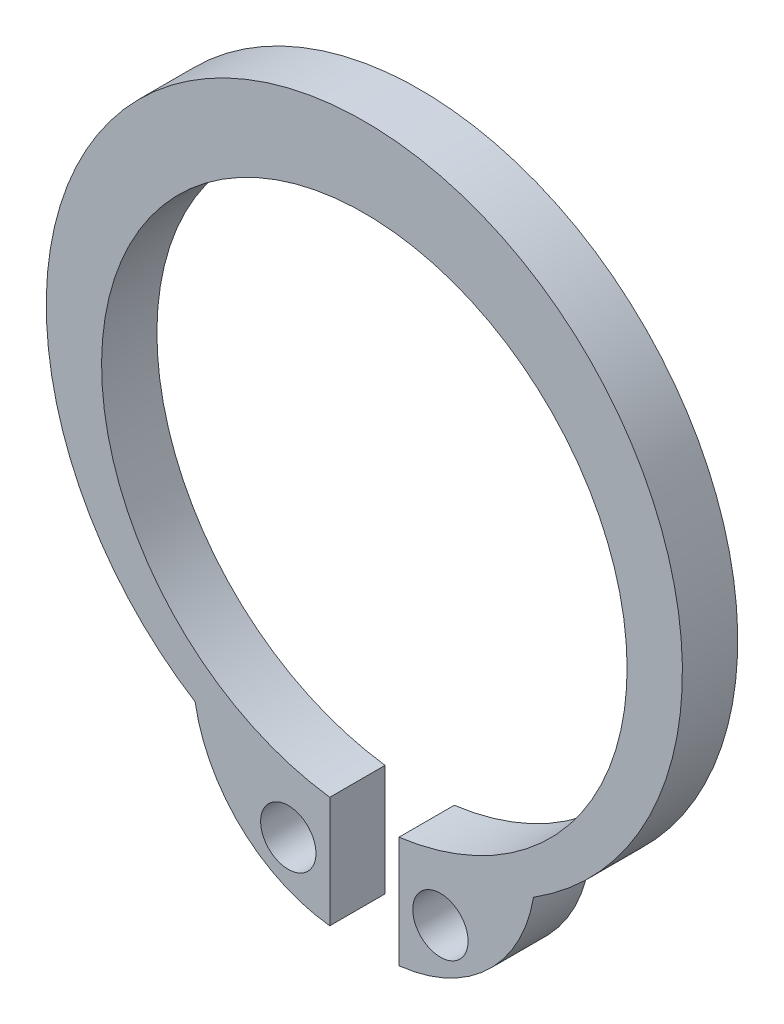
ISO-10303-21;
HEADER;
FILE_DESCRIPTION(('STEP AP214'),'2;1');
FILE_NAME('part.step','',(''),(''),'','','');
FILE_SCHEMA(('AUTOMOTIVE_DESIGN { 1 0 10303 214 1 1 1 1 }'));
ENDSEC;
DATA;
#1=APPLICATION_CONTEXT('core data for automotive mechanical design processes');
#2=APPLICATION_PROTOCOL_DEFINITION('international standard','automotive_design',2000,#1);
#3=PRODUCT_CONTEXT('',#1,'mechanical');
#4=PRODUCT('Part','Part','',(#3));
#5=PRODUCT_RELATED_PRODUCT_CATEGORY('part','',(#4));
#6=PRODUCT_DEFINITION_FORMATION('','',#4);
#7=PRODUCT_DEFINITION_CONTEXT('part definition',#1,'design');
#8=PRODUCT_DEFINITION('design','',#6,#7);
#9=PRODUCT_DEFINITION_SHAPE('','',#8);
#10=(LENGTH_UNIT() NAMED_UNIT(*) SI_UNIT(.MILLI.,.METRE.));
#11=(NAMED_UNIT(*) PLANE_ANGLE_UNIT() SI_UNIT($,.RADIAN.));
#12=(NAMED_UNIT(*) SI_UNIT($,.STERADIAN.) SOLID_ANGLE_UNIT());
#13=UNCERTAINTY_MEASURE_WITH_UNIT(LENGTH_MEASURE(1.E-05),#10,'distance_accuracy_value','');
#14=(GEOMETRIC_REPRESENTATION_CONTEXT(3) GLOBAL_UNCERTAINTY_ASSIGNED_CONTEXT((#13)) GLOBAL_UNIT_ASSIGNED_CONTEXT((#10,
#11,#12)) REPRESENTATION_CONTEXT('',''));
#15=CARTESIAN_POINT('',(0.,0.,0.));
#16=DIRECTION('',(0.,0.,1.));
#17=DIRECTION('',(1.,0.,0.));
#18=AXIS2_PLACEMENT_3D('',#15,#16,#17);
#19=CARTESIAN_POINT('',(0.,0.,0.8));
#20=DIRECTION('',(0.,0.,1.));
#21=DIRECTION('',(1.,0.,0.));
#22=AXIS2_PLACEMENT_3D('',#19,#20,#21);
#23=PLANE('',#22);
#24=CARTESIAN_POINT('',(0.,0.,0.8));
#25=DIRECTION('',(0.,0.,1.));
#26=DIRECTION('',(1.,0.,0.));
#27=AXIS2_PLACEMENT_3D('',#24,#25,#26);
#28=CIRCLE('',#27,3.8);
#29=CARTESIAN_POINT('',(0.500000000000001,-3.76696164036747,0.8));
#30=VERTEX_POINT('',#29);
#31=CARTESIAN_POINT('',(-0.500000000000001,-3.76696164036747,0.8));
#32=VERTEX_POINT('',#31);
#33=EDGE_CURVE('E81',#30,#32,#28,.T.);
#34=ORIENTED_EDGE('',*,*,#33,.F.);
#35=DIRECTION('',(0.,-1.,0.));
#36=VECTOR('',#35,1.);
#37=CARTESIAN_POINT('',(0.500000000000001,-3.76696164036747,0.8));
#38=LINE('',#37,#36);
#39=CARTESIAN_POINT('',(0.5,-5.37680202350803,0.8));
#40=VERTEX_POINT('',#39);
#41=EDGE_CURVE('E87',#30,#40,#38,.T.);
#42=ORIENTED_EDGE('',*,*,#41,.T.);
#43=CARTESIAN_POINT('',(0.262823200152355,-3.17386985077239,0.8));
#44=DIRECTION('',(0.,0.,1.));
#45=DIRECTION('',(1.,0.,0.));
#46=AXIS2_PLACEMENT_3D('',#43,#44,#45);
#47=CIRCLE('',#46,2.21566310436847);
#48=CARTESIAN_POINT('',(2.44717580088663,-3.54503922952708,0.8));
#49=VERTEX_POINT('',#48);
#50=EDGE_CURVE('E122',#40,#49,#47,.T.);
#51=ORIENTED_EDGE('',*,*,#50,.T.);
#52=CARTESIAN_POINT('',(0.,0.35,0.8));
#53=DIRECTION('',(0.,0.,1.));
#54=DIRECTION('',(1.,0.,0.));
#55=AXIS2_PLACEMENT_3D('',#52,#53,#54);
#56=CIRCLE('',#55,4.6);
#57=CARTESIAN_POINT('',(-2.44717580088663,-3.54503922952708,0.8));
#58=VERTEX_POINT('',#57);
#59=EDGE_CURVE('E119',#49,#58,#56,.T.);
#60=ORIENTED_EDGE('',*,*,#59,.T.);
#61=CARTESIAN_POINT('',(-0.262823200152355,-3.17386985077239,0.8));
#62=DIRECTION('',(0.,0.,-1.));
#63=DIRECTION('',(-1.,0.,0.));
#64=AXIS2_PLACEMENT_3D('',#61,#62,#63);
#65=CIRCLE('',#64,2.21566310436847);
#66=CARTESIAN_POINT('',(-0.500000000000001,-5.37680202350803,0.8));
#67=VERTEX_POINT('',#66);
#68=EDGE_CURVE('E116',#67,#58,#65,.T.);
#69=ORIENTED_EDGE('',*,*,#68,.F.);
#70=DIRECTION('',(0.,-1.,0.));
#71=VECTOR('',#70,1.);
#72=CARTESIAN_POINT('',(-0.500000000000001,-3.76696164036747,0.8));
#73=LINE('',#72,#71);
#74=EDGE_CURVE('E114',#32,#67,#73,.T.);
#75=ORIENTED_EDGE('',*,*,#74,.F.);
#76=EDGE_LOOP('',(#34,#42,#51,#60,#69,#75));
#77=FACE_BOUND('',#76,.T.);
#78=CARTESIAN_POINT('',(-1.1,-4.56946386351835,0.8));
#79=DIRECTION('',(0.,0.,1.));
#80=DIRECTION('',(1.,0.,0.));
#81=AXIS2_PLACEMENT_3D('',#78,#79,#80);
#82=CIRCLE('',#81,0.4);
#83=CARTESIAN_POINT('',(-0.700000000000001,-4.56946386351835,0.8));
#84=VERTEX_POINT('',#83);
#85=EDGE_CURVE('E176',#84,#84,#82,.T.);
#86=ORIENTED_EDGE('',*,*,#85,.F.);
#87=EDGE_LOOP('',(#86));
#88=FACE_BOUND('',#87,.T.);
#89=CARTESIAN_POINT('',(1.1,-4.56946386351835,0.8));
#90=DIRECTION('',(0.,0.,-1.));
#91=DIRECTION('',(-1.,0.,0.));
#92=AXIS2_PLACEMENT_3D('',#89,#90,#91);
#93=CIRCLE('',#92,0.4);
#94=CARTESIAN_POINT('',(0.700000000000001,-4.56946386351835,0.8));
#95=VERTEX_POINT('',#94);
#96=EDGE_CURVE('E180',#95,#95,#93,.T.);
#97=ORIENTED_EDGE('',*,*,#96,.T.);
#98=EDGE_LOOP('',(#97));
#99=FACE_BOUND('',#98,.T.);
#100=ADVANCED_FACE('F27',(#77,#88,#99),#23,.T.);
#101=CARTESIAN_POINT('',(0.,0.,0.));
#102=DIRECTION('',(0.,0.,1.));
#103=DIRECTION('',(1.,0.,0.));
#104=AXIS2_PLACEMENT_3D('',#101,#102,#103);
#105=PLANE('',#104);
#106=CARTESIAN_POINT('',(0.,0.,0.));
#107=DIRECTION('',(0.,0.,1.));
#108=DIRECTION('',(1.,0.,0.));
#109=AXIS2_PLACEMENT_3D('',#106,#107,#108);
#110=CIRCLE('',#109,3.8);
#111=CARTESIAN_POINT('',(0.500000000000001,-3.76696164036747,0.));
#112=VERTEX_POINT('',#111);
#113=CARTESIAN_POINT('',(-0.500000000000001,-3.76696164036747,0.));
#114=VERTEX_POINT('',#113);
#115=EDGE_CURVE('E79',#112,#114,#110,.T.);
#116=ORIENTED_EDGE('',*,*,#115,.T.);
#117=DIRECTION('',(0.,-1.,0.));
#118=VECTOR('',#117,1.);
#119=CARTESIAN_POINT('',(-0.500000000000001,-3.76696164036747,0.));
#120=LINE('',#119,#118);
#121=CARTESIAN_POINT('',(-0.500000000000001,-5.37680202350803,0.));
#122=VERTEX_POINT('',#121);
#123=EDGE_CURVE('E94',#114,#122,#120,.T.);
#124=ORIENTED_EDGE('',*,*,#123,.T.);
#125=CARTESIAN_POINT('',(-0.262823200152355,-3.17386985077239,0.));
#126=DIRECTION('',(0.,0.,-1.));
#127=DIRECTION('',(-1.,0.,0.));
#128=AXIS2_PLACEMENT_3D('',#125,#126,#127);
#129=CIRCLE('',#128,2.21566310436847);
#130=CARTESIAN_POINT('',(-2.44717580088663,-3.54503922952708,0.));
#131=VERTEX_POINT('',#130);
#132=EDGE_CURVE('E101',#122,#131,#129,.T.);
#133=ORIENTED_EDGE('',*,*,#132,.T.);
#134=CARTESIAN_POINT('',(0.,0.35,0.));
#135=DIRECTION('',(0.,0.,1.));
#136=DIRECTION('',(1.,0.,0.));
#137=AXIS2_PLACEMENT_3D('',#134,#135,#136);
#138=CIRCLE('',#137,4.6);
#139=CARTESIAN_POINT('',(2.44717580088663,-3.54503922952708,0.));
#140=VERTEX_POINT('',#139);
#141=EDGE_CURVE('E103',#140,#131,#138,.T.);
#142=ORIENTED_EDGE('',*,*,#141,.F.);
#143=CARTESIAN_POINT('',(0.262823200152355,-3.17386985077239,0.));
#144=DIRECTION('',(0.,0.,1.));
#145=DIRECTION('',(1.,0.,0.));
#146=AXIS2_PLACEMENT_3D('',#143,#144,#145);
#147=CIRCLE('',#146,2.21566310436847);
#148=CARTESIAN_POINT('',(0.5,-5.37680202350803,0.));
#149=VERTEX_POINT('',#148);
#150=EDGE_CURVE('E109',#149,#140,#147,.T.);
#151=ORIENTED_EDGE('',*,*,#150,.F.);
#152=DIRECTION('',(0.,-1.,0.));
#153=VECTOR('',#152,1.);
#154=CARTESIAN_POINT('',(0.500000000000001,-3.76696164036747,0.));
#155=LINE('',#154,#153);
#156=EDGE_CURVE('E97',#112,#149,#155,.T.);
#157=ORIENTED_EDGE('',*,*,#156,.F.);
#158=EDGE_LOOP('',(#116,#124,#133,#142,#151,#157));
#159=FACE_BOUND('',#158,.T.);
#160=CARTESIAN_POINT('',(-1.1,-4.56946386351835,0.));
#161=DIRECTION('',(0.,0.,1.));
#162=DIRECTION('',(1.,0.,0.));
#163=AXIS2_PLACEMENT_3D('',#160,#161,#162);
#164=CIRCLE('',#163,0.4);
#165=CARTESIAN_POINT('',(-0.700000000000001,-4.56946386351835,0.));
#166=VERTEX_POINT('',#165);
#167=EDGE_CURVE('E98',#166,#166,#164,.T.);
#168=ORIENTED_EDGE('',*,*,#167,.T.);
#169=EDGE_LOOP('',(#168));
#170=FACE_BOUND('',#169,.T.);
#171=CARTESIAN_POINT('',(1.1,-4.56946386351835,0.));
#172=DIRECTION('',(0.,0.,-1.));
#173=DIRECTION('',(-1.,0.,0.));
#174=AXIS2_PLACEMENT_3D('',#171,#172,#173);
#175=CIRCLE('',#174,0.4);
#176=CARTESIAN_POINT('',(0.700000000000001,-4.56946386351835,0.));
#177=VERTEX_POINT('',#176);
#178=EDGE_CURVE('E177',#177,#177,#175,.T.);
#179=ORIENTED_EDGE('',*,*,#178,.F.);
#180=EDGE_LOOP('',(#179));
#181=FACE_BOUND('',#180,.T.);
#182=ADVANCED_FACE('F91',(#159,#170,#181),#105,.F.);
#183=CARTESIAN_POINT('',(0.,0.,0.8));
#184=DIRECTION('',(0.,0.,-1.));
#185=DIRECTION('',(-1.,0.,0.));
#186=AXIS2_PLACEMENT_3D('',#183,#184,#185);
#187=CYLINDRICAL_SURFACE('',#186,3.8);
#188=DIRECTION('',(0.,0.,-1.));
#189=VECTOR('',#188,1.);
#190=CARTESIAN_POINT('',(0.500000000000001,-3.76696164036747,0.8));
#191=LINE('',#190,#189);
#192=EDGE_CURVE('E11',#30,#112,#191,.T.);
#193=ORIENTED_EDGE('',*,*,#192,.F.);
#194=ORIENTED_EDGE('',*,*,#33,.T.);
#195=DIRECTION('',(0.,0.,-1.));
#196=VECTOR('',#195,1.);
#197=CARTESIAN_POINT('',(-0.500000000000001,-3.76696164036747,0.8));
#198=LINE('',#197,#196);
#199=EDGE_CURVE('E76',#32,#114,#198,.T.);
#200=ORIENTED_EDGE('',*,*,#199,.T.);
#201=ORIENTED_EDGE('',*,*,#115,.F.);
#202=EDGE_LOOP('',(#193,#194,#200,#201));
#203=FACE_BOUND('',#202,.T.);
#204=ADVANCED_FACE('F78',(#203),#187,.F.);
#205=CARTESIAN_POINT('',(0.500000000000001,-3.76696164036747,0.8));
#206=DIRECTION('',(1.,0.,0.));
#207=DIRECTION('',(0.,0.,-1.));
#208=AXIS2_PLACEMENT_3D('',#205,#206,#207);
#209=PLANE('',#208);
#210=DIRECTION('',(0.,0.,-1.));
#211=VECTOR('',#210,1.);
#212=CARTESIAN_POINT('',(0.5,-5.37680202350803,0.8));
#213=LINE('',#212,#211);
#214=EDGE_CURVE('E35',#40,#149,#213,.T.);
#215=ORIENTED_EDGE('',*,*,#214,.F.);
#216=ORIENTED_EDGE('',*,*,#41,.F.);
#217=ORIENTED_EDGE('',*,*,#192,.T.);
#218=ORIENTED_EDGE('',*,*,#156,.T.);
#219=EDGE_LOOP('',(#215,#216,#217,#218));
#220=FACE_BOUND('',#219,.T.);
#221=ADVANCED_FACE('F29',(#220),#209,.F.);
#222=CARTESIAN_POINT('',(0.262823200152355,-3.17386985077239,0.8));
#223=DIRECTION('',(0.,0.,-1.));
#224=DIRECTION('',(-1.,0.,0.));
#225=AXIS2_PLACEMENT_3D('',#222,#223,#224);
#226=CYLINDRICAL_SURFACE('',#225,2.21566310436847);
#227=DIRECTION('',(0.,0.,-1.));
#228=VECTOR('',#227,1.);
#229=CARTESIAN_POINT('',(2.44717580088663,-3.54503922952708,0.8));
#230=LINE('',#229,#228);
#231=EDGE_CURVE('E130',#49,#140,#230,.T.);
#232=ORIENTED_EDGE('',*,*,#231,.F.);
#233=ORIENTED_EDGE('',*,*,#50,.F.);
#234=ORIENTED_EDGE('',*,*,#214,.T.);
#235=ORIENTED_EDGE('',*,*,#150,.T.);
#236=EDGE_LOOP('',(#232,#233,#234,#235));
#237=FACE_BOUND('',#236,.T.);
#238=ADVANCED_FACE('F132',(#237),#226,.T.);
#239=CARTESIAN_POINT('',(0.,0.35,0.8));
#240=DIRECTION('',(0.,0.,-1.));
#241=DIRECTION('',(-1.,0.,0.));
#242=AXIS2_PLACEMENT_3D('',#239,#240,#241);
#243=CYLINDRICAL_SURFACE('',#242,4.6);
#244=DIRECTION('',(0.,0.,-1.));
#245=VECTOR('',#244,1.);
#246=CARTESIAN_POINT('',(-2.44717580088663,-3.54503922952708,0.8));
#247=LINE('',#246,#245);
#248=EDGE_CURVE('E128',#58,#131,#247,.T.);
#249=ORIENTED_EDGE('',*,*,#248,.F.);
#250=ORIENTED_EDGE('',*,*,#59,.F.);
#251=ORIENTED_EDGE('',*,*,#231,.T.);
#252=ORIENTED_EDGE('',*,*,#141,.T.);
#253=EDGE_LOOP('',(#249,#250,#251,#252));
#254=FACE_BOUND('',#253,.T.);
#255=ADVANCED_FACE('F141',(#254),#243,.T.);
#256=CARTESIAN_POINT('',(-0.262823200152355,-3.17386985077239,0.8));
#257=DIRECTION('',(0.,0.,-1.));
#258=DIRECTION('',(-1.,0.,0.));
#259=AXIS2_PLACEMENT_3D('',#256,#257,#258);
#260=CYLINDRICAL_SURFACE('',#259,2.21566310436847);
#261=DIRECTION('',(0.,0.,-1.));
#262=VECTOR('',#261,1.);
#263=CARTESIAN_POINT('',(-0.500000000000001,-5.37680202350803,0.8));
#264=LINE('',#263,#262);
#265=EDGE_CURVE('E86',#67,#122,#264,.T.);
#266=ORIENTED_EDGE('',*,*,#265,.F.);
#267=ORIENTED_EDGE('',*,*,#68,.T.);
#268=ORIENTED_EDGE('',*,*,#248,.T.);
#269=ORIENTED_EDGE('',*,*,#132,.F.);
#270=EDGE_LOOP('',(#266,#267,#268,#269));
#271=FACE_BOUND('',#270,.T.);
#272=ADVANCED_FACE('F139',(#271),#260,.T.);
#273=CARTESIAN_POINT('',(-0.500000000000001,-3.76696164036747,0.8));
#274=DIRECTION('',(1.,0.,0.));
#275=DIRECTION('',(0.,0.,-1.));
#276=AXIS2_PLACEMENT_3D('',#273,#274,#275);
#277=PLANE('',#276);
#278=ORIENTED_EDGE('',*,*,#74,.T.);
#279=ORIENTED_EDGE('',*,*,#265,.T.);
#280=ORIENTED_EDGE('',*,*,#123,.F.);
#281=ORIENTED_EDGE('',*,*,#199,.F.);
#282=EDGE_LOOP('',(#278,#279,#280,#281));
#283=FACE_BOUND('',#282,.T.);
#284=ADVANCED_FACE('F100',(#283),#277,.T.);
#285=CARTESIAN_POINT('',(-1.1,-4.56946386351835,0.));
#286=DIRECTION('',(0.,0.,1.));
#287=DIRECTION('',(1.,0.,0.));
#288=AXIS2_PLACEMENT_3D('',#285,#286,#287);
#289=CYLINDRICAL_SURFACE('',#288,0.4);
#290=ORIENTED_EDGE('',*,*,#167,.F.);
#291=EDGE_LOOP('',(#290));
#292=FACE_BOUND('',#291,.T.);
#293=ORIENTED_EDGE('',*,*,#85,.T.);
#294=EDGE_LOOP('',(#293));
#295=FACE_BOUND('',#294,.T.);
#296=ADVANCED_FACE('F160',(#292,#295),#289,.F.);
#297=CARTESIAN_POINT('',(1.1,-4.56946386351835,0.));
#298=DIRECTION('',(0.,0.,1.));
#299=DIRECTION('',(1.,0.,0.));
#300=AXIS2_PLACEMENT_3D('',#297,#298,#299);
#301=CYLINDRICAL_SURFACE('',#300,0.4);
#302=ORIENTED_EDGE('',*,*,#178,.T.);
#303=EDGE_LOOP('',(#302));
#304=FACE_BOUND('',#303,.T.);
#305=ORIENTED_EDGE('',*,*,#96,.F.);
#306=EDGE_LOOP('',(#305));
#307=FACE_BOUND('',#306,.T.);
#308=ADVANCED_FACE('F164',(#304,#307),#301,.F.);
#309=CLOSED_SHELL('',(#100,#182,#204,#221,#238,#255,#272,#284,#296,#308));
#310=MANIFOLD_SOLID_BREP('B2',#309);
#311=ADVANCED_BREP_SHAPE_REPRESENTATION('',(#18,#310),#14);
#312=SHAPE_DEFINITION_REPRESENTATION(#9,#311);
ENDSEC;
END-ISO-10303-21;
